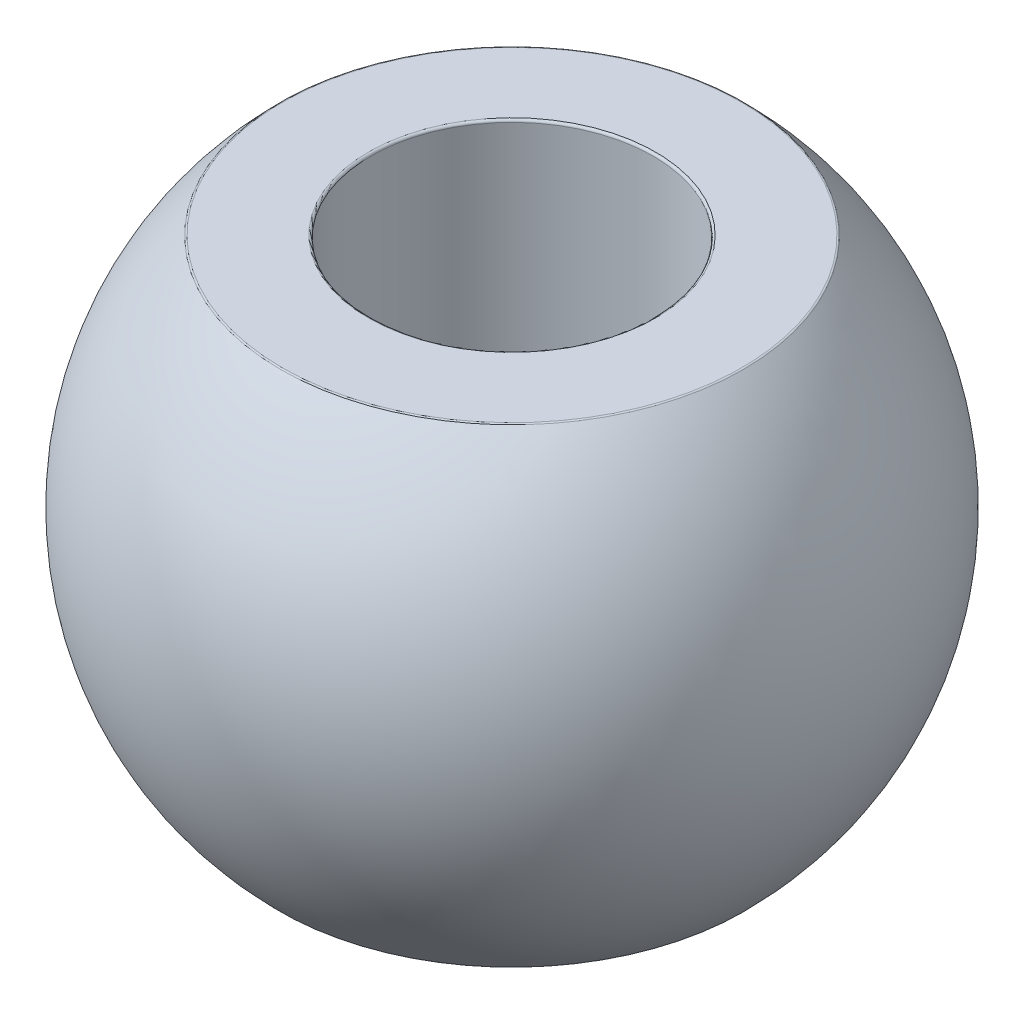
from build123d import *

# Parameters (mm, degrees)
FILLET1_R = 0.1


with BuildPart() as part:
    # Sketch1 → Revolve1 (revolve)
    with BuildSketch(Plane.XY, mode=Mode.PRIVATE) as revolve1_sk:
        with BuildLine():
            Line((6, -10), (6, 10))
            Line((6, 10), (9.797958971, 10))
            ThreePointArc((9.797958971, 10), (14, 0), (9.797958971, -10))
            Line((9.797958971, -10), (6, -10))
        make_face()
    revolve(revolve1_sk.sketch.rotate(Axis((0, 0, 0), (0, 1, 0)), 90), axis=Axis((0, 0, 0), (0, 1, 0)))

    # Fillet1
    fillet1_edges = [part.edges().sort_by_distance(p)[0] for p in [
        (0, -10, 9.797958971),
        (0, 10, 9.797958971),
        (0, 10, 6),
        (0, -10, 6),
    ]]
    fillet(fillet1_edges, radius=FILLET1_R)


solid = part.part
